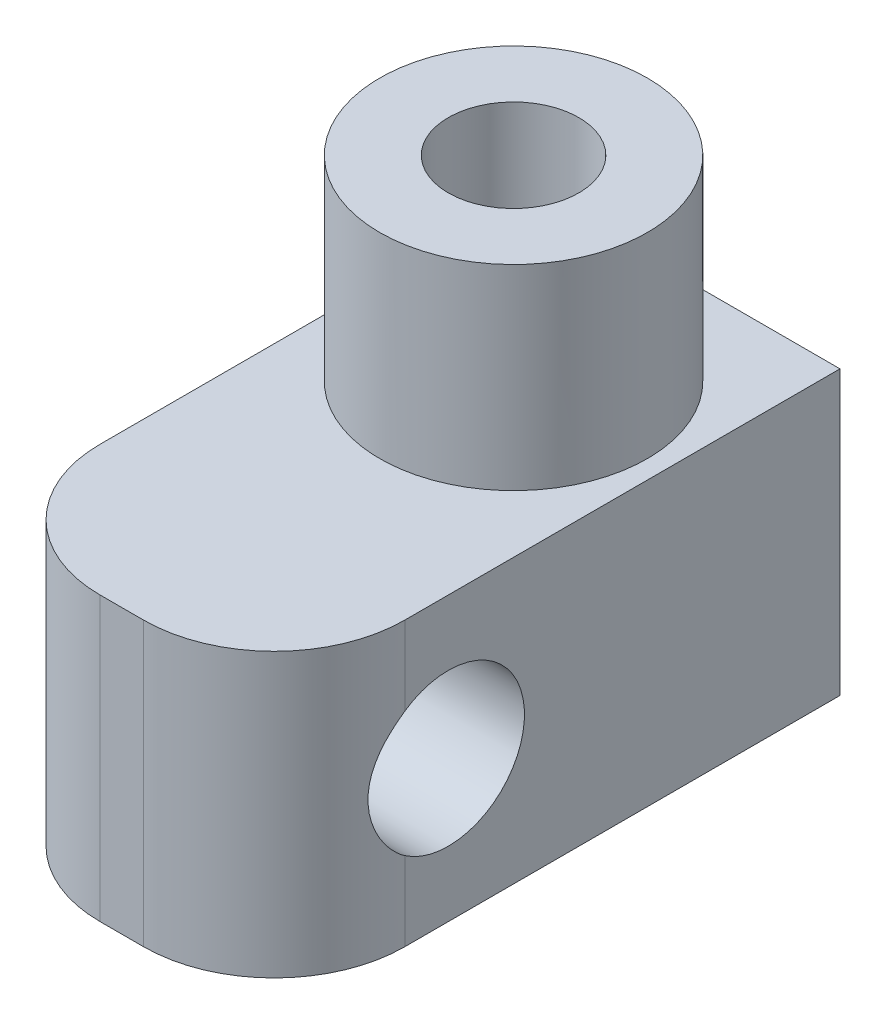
ISO-10303-21;
HEADER;
FILE_DESCRIPTION(('STEP AP214'),'2;1');
FILE_NAME('part.step','',(''),(''),'','','');
FILE_SCHEMA(('AUTOMOTIVE_DESIGN { 1 0 10303 214 1 1 1 1 }'));
ENDSEC;
DATA;
#1=APPLICATION_CONTEXT('core data for automotive mechanical design processes');
#2=APPLICATION_PROTOCOL_DEFINITION('international standard','automotive_design',2000,#1);
#3=PRODUCT_CONTEXT('',#1,'mechanical');
#4=PRODUCT('Part','Part','',(#3));
#5=PRODUCT_RELATED_PRODUCT_CATEGORY('part','',(#4));
#6=PRODUCT_DEFINITION_FORMATION('','',#4);
#7=PRODUCT_DEFINITION_CONTEXT('part definition',#1,'design');
#8=PRODUCT_DEFINITION('design','',#6,#7);
#9=PRODUCT_DEFINITION_SHAPE('','',#8);
#10=(LENGTH_UNIT() NAMED_UNIT(*) SI_UNIT(.MILLI.,.METRE.));
#11=(NAMED_UNIT(*) PLANE_ANGLE_UNIT() SI_UNIT($,.RADIAN.));
#12=(NAMED_UNIT(*) SI_UNIT($,.STERADIAN.) SOLID_ANGLE_UNIT());
#13=UNCERTAINTY_MEASURE_WITH_UNIT(LENGTH_MEASURE(1.E-05),#10,'distance_accuracy_value','');
#14=(GEOMETRIC_REPRESENTATION_CONTEXT(3) GLOBAL_UNCERTAINTY_ASSIGNED_CONTEXT((#13)) GLOBAL_UNIT_ASSIGNED_CONTEXT((#10,
#11,#12)) REPRESENTATION_CONTEXT('',''));
#15=CARTESIAN_POINT('',(0.,0.,0.));
#16=DIRECTION('',(0.,0.,1.));
#17=DIRECTION('',(1.,0.,0.));
#18=AXIS2_PLACEMENT_3D('',#15,#16,#17);
#19=CARTESIAN_POINT('',(0.,0.,0.));
#20=DIRECTION('',(0.,1.,0.));
#21=DIRECTION('',(0.,0.,1.));
#22=AXIS2_PLACEMENT_3D('',#19,#20,#21);
#23=CYLINDRICAL_SURFACE('',#22,1.5);
#24=CARTESIAN_POINT('',(0.,11.,0.));
#25=DIRECTION('',(0.,1.,0.));
#26=DIRECTION('',(0.,0.,1.));
#27=AXIS2_PLACEMENT_3D('',#24,#25,#26);
#28=CIRCLE('',#27,1.5);
#29=CARTESIAN_POINT('',(0.,11.,1.5));
#30=VERTEX_POINT('',#29);
#31=EDGE_CURVE('E165',#30,#30,#28,.T.);
#32=ORIENTED_EDGE('',*,*,#31,.T.);
#33=EDGE_LOOP('',(#32));
#34=FACE_BOUND('',#33,.T.);
#35=CARTESIAN_POINT('',(0.,2.,0.));
#36=DIRECTION('',(0.,-1.,0.));
#37=DIRECTION('',(0.,0.,-1.));
#38=AXIS2_PLACEMENT_3D('',#35,#36,#37);
#39=CIRCLE('',#38,1.5);
#40=CARTESIAN_POINT('',(0.,2.,-1.5));
#41=VERTEX_POINT('',#40);
#42=EDGE_CURVE('E37',#41,#41,#39,.F.);
#43=ORIENTED_EDGE('',*,*,#42,.F.);
#44=EDGE_LOOP('',(#43));
#45=FACE_BOUND('',#44,.T.);
#46=ADVANCED_FACE('F33',(#34,#45),#23,.F.);
#47=CARTESIAN_POINT('',(0.,11.,0.));
#48=DIRECTION('',(0.,-1.,0.));
#49=DIRECTION('',(0.,0.,-1.));
#50=AXIS2_PLACEMENT_3D('',#47,#48,#49);
#51=CYLINDRICAL_SURFACE('',#50,3.075);
#52=CARTESIAN_POINT('',(0.,11.,0.));
#53=DIRECTION('',(0.,1.,0.));
#54=DIRECTION('',(0.,0.,1.));
#55=AXIS2_PLACEMENT_3D('',#52,#53,#54);
#56=CIRCLE('',#55,3.075);
#57=CARTESIAN_POINT('',(0.,11.,3.075));
#58=VERTEX_POINT('',#57);
#59=EDGE_CURVE('E42',#58,#58,#56,.T.);
#60=ORIENTED_EDGE('',*,*,#59,.F.);
#61=EDGE_LOOP('',(#60));
#62=FACE_BOUND('',#61,.T.);
#63=CARTESIAN_POINT('',(0.,6.5,0.));
#64=DIRECTION('',(0.,-1.,0.));
#65=DIRECTION('',(0.,0.,-1.));
#66=AXIS2_PLACEMENT_3D('',#63,#64,#65);
#67=CIRCLE('',#66,3.075);
#68=CARTESIAN_POINT('',(0.,6.5,-3.075));
#69=VERTEX_POINT('',#68);
#70=EDGE_CURVE('E11',#69,#69,#67,.T.);
#71=ORIENTED_EDGE('',*,*,#70,.F.);
#72=EDGE_LOOP('',(#71));
#73=FACE_BOUND('',#72,.T.);
#74=ADVANCED_FACE('F35',(#62,#73),#51,.T.);
#75=CARTESIAN_POINT('',(0.,11.,0.));
#76=DIRECTION('',(0.,1.,0.));
#77=DIRECTION('',(0.,0.,1.));
#78=AXIS2_PLACEMENT_3D('',#75,#76,#77);
#79=PLANE('',#78);
#80=ORIENTED_EDGE('',*,*,#31,.F.);
#81=EDGE_LOOP('',(#80));
#82=FACE_BOUND('',#81,.T.);
#83=ORIENTED_EDGE('',*,*,#59,.T.);
#84=EDGE_LOOP('',(#83));
#85=FACE_BOUND('',#84,.T.);
#86=ADVANCED_FACE('F238',(#82,#85),#79,.T.);
#87=CARTESIAN_POINT('',(-3.5,6.5,-4.));
#88=DIRECTION('',(0.,0.,-1.));
#89=DIRECTION('',(-1.,0.,0.));
#90=AXIS2_PLACEMENT_3D('',#87,#88,#89);
#91=PLANE('',#90);
#92=DIRECTION('',(1.,0.,0.));
#93=VECTOR('',#92,1.);
#94=CARTESIAN_POINT('',(-3.5,0.,-4.));
#95=LINE('',#94,#93);
#96=CARTESIAN_POINT('',(-3.5,0.,-4.));
#97=VERTEX_POINT('',#96);
#98=CARTESIAN_POINT('',(3.5,0.,-4.));
#99=VERTEX_POINT('',#98);
#100=EDGE_CURVE('E175',#97,#99,#95,.T.);
#101=ORIENTED_EDGE('',*,*,#100,.F.);
#102=DIRECTION('',(0.,-1.,0.));
#103=VECTOR('',#102,1.);
#104=CARTESIAN_POINT('',(-3.5,6.5,-4.));
#105=LINE('',#104,#103);
#106=CARTESIAN_POINT('',(-3.5,6.5,-4.));
#107=VERTEX_POINT('',#106);
#108=EDGE_CURVE('E126',#107,#97,#105,.T.);
#109=ORIENTED_EDGE('',*,*,#108,.F.);
#110=DIRECTION('',(1.,0.,0.));
#111=VECTOR('',#110,1.);
#112=CARTESIAN_POINT('',(-3.5,6.5,-4.));
#113=LINE('',#112,#111);
#114=CARTESIAN_POINT('',(3.5,6.5,-4.));
#115=VERTEX_POINT('',#114);
#116=EDGE_CURVE('E157',#107,#115,#113,.T.);
#117=ORIENTED_EDGE('',*,*,#116,.T.);
#118=DIRECTION('',(0.,-1.,0.));
#119=VECTOR('',#118,1.);
#120=CARTESIAN_POINT('',(3.5,6.5,-4.));
#121=LINE('',#120,#119);
#122=EDGE_CURVE('E120',#115,#99,#121,.T.);
#123=ORIENTED_EDGE('',*,*,#122,.T.);
#124=EDGE_LOOP('',(#101,#109,#117,#123));
#125=FACE_BOUND('',#124,.T.);
#126=ADVANCED_FACE('F223',(#125),#91,.T.);
#127=CARTESIAN_POINT('',(-3.5,6.5,5.99999999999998));
#128=DIRECTION('',(-1.,0.,0.));
#129=DIRECTION('',(0.,0.,1.));
#130=AXIS2_PLACEMENT_3D('',#127,#128,#129);
#131=PLANE('',#130);
#132=CARTESIAN_POINT('',(-3.5,3.25,5.));
#133=DIRECTION('',(-1.,0.,0.));
#134=DIRECTION('',(0.,0.,1.));
#135=AXIS2_PLACEMENT_3D('',#132,#133,#134);
#136=CIRCLE('',#135,1.75);
#137=CARTESIAN_POINT('',(-3.5,4.68614066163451,5.99999999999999));
#138=VERTEX_POINT('',#137);
#139=CARTESIAN_POINT('',(-3.5,1.81385933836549,5.99999999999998));
#140=VERTEX_POINT('',#139);
#141=EDGE_CURVE('E48',#138,#140,#136,.T.);
#142=ORIENTED_EDGE('',*,*,#141,.F.);
#143=DIRECTION('',(0.,-1.,0.));
#144=VECTOR('',#143,1.);
#145=CARTESIAN_POINT('',(-3.5,6.5,5.99999999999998));
#146=LINE('',#145,#144);
#147=CARTESIAN_POINT('',(-3.5,6.5,5.99999999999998));
#148=VERTEX_POINT('',#147);
#149=EDGE_CURVE('E129',#148,#138,#146,.T.);
#150=ORIENTED_EDGE('',*,*,#149,.F.);
#151=DIRECTION('',(0.,0.,-1.));
#152=VECTOR('',#151,1.);
#153=CARTESIAN_POINT('',(-3.5,6.5,5.99999999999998));
#154=LINE('',#153,#152);
#155=EDGE_CURVE('E124',#148,#107,#154,.T.);
#156=ORIENTED_EDGE('',*,*,#155,.T.);
#157=ORIENTED_EDGE('',*,*,#108,.T.);
#158=DIRECTION('',(0.,0.,-1.));
#159=VECTOR('',#158,1.);
#160=CARTESIAN_POINT('',(-3.5,0.,5.99999999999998));
#161=LINE('',#160,#159);
#162=CARTESIAN_POINT('',(-3.5,0.,5.99999999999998));
#163=VERTEX_POINT('',#162);
#164=EDGE_CURVE('E139',#163,#97,#161,.T.);
#165=ORIENTED_EDGE('',*,*,#164,.F.);
#166=EDGE_CURVE('E136',#140,#163,#146,.T.);
#167=ORIENTED_EDGE('',*,*,#166,.F.);
#168=EDGE_LOOP('',(#142,#150,#156,#157,#165,#167));
#169=FACE_BOUND('',#168,.T.);
#170=ADVANCED_FACE('F156',(#169),#131,.T.);
#171=CARTESIAN_POINT('',(-0.499999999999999,6.5,5.99999999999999));
#172=DIRECTION('',(0.,-1.,0.));
#173=DIRECTION('',(0.,0.,-1.));
#174=AXIS2_PLACEMENT_3D('',#171,#172,#173);
#175=CYLINDRICAL_SURFACE('',#174,3.);
#176=CARTESIAN_POINT('',(-3.5,1.81385933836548,5.99999999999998));
#177=CARTESIAN_POINT('',(-3.50000169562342,1.84168165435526,6.03995888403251));
#178=CARTESIAN_POINT('',(-3.49920147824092,1.87115612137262,6.07872827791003));
#179=CARTESIAN_POINT('',(-3.49629741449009,1.93318979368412,6.15363572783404));
#180=CARTESIAN_POINT('',(-3.49419414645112,1.9657476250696,6.18977494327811));
#181=CARTESIAN_POINT('',(-3.48639021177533,2.06760227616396,6.29376343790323));
#182=CARTESIAN_POINT('',(-3.47919269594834,2.1412082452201,6.3573667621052));
#183=CARTESIAN_POINT('',(-3.46329629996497,2.29768029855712,6.47138199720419));
#184=CARTESIAN_POINT('',(-3.45459884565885,2.38053756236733,6.52180632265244));
#185=CARTESIAN_POINT('',(-3.43800373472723,2.55352099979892,6.60834182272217));
#186=CARTESIAN_POINT('',(-3.43010615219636,2.64364784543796,6.64445167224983));
#187=CARTESIAN_POINT('',(-3.41689427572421,2.83062169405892,6.70187174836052));
#188=CARTESIAN_POINT('',(-3.41163289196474,2.92756494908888,6.72288226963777));
#189=CARTESIAN_POINT('',(-3.40522265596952,3.12373481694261,6.7482368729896));
#190=CARTESIAN_POINT('',(-3.40407291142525,3.22296092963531,6.75258457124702));
#191=CARTESIAN_POINT('',(-3.40613155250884,3.417734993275,6.74458757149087));
#192=CARTESIAN_POINT('',(-3.40921202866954,3.51330492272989,6.73273283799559));
#193=CARTESIAN_POINT('',(-3.41879004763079,3.70106465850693,6.69358823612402));
#194=CARTESIAN_POINT('',(-3.4252884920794,3.79325356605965,6.66629429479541));
#195=CARTESIAN_POINT('',(-3.44023244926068,3.97227100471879,6.59690166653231));
#196=CARTESIAN_POINT('',(-3.44868835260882,4.05906767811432,6.55472332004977));
#197=CARTESIAN_POINT('',(-3.46544777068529,4.22454651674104,6.45670830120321));
#198=CARTESIAN_POINT('',(-3.47375136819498,4.30323320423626,6.40087929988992));
#199=CARTESIAN_POINT('',(-3.48639910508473,4.43544099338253,6.28960866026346));
#200=CARTESIAN_POINT('',(-3.49120548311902,4.49082037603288,6.23641419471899));
#201=CARTESIAN_POINT('',(-3.49801131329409,4.59422984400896,6.123144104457));
#202=CARTESIAN_POINT('',(-3.50001035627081,4.64225885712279,6.06306747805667));
#203=CARTESIAN_POINT('',(-3.5,4.68614066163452,5.99999999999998));
#204=B_SPLINE_CURVE_WITH_KNOTS('',3,(#176,#177,#178,#179,#180,#181,#182,#183,#184,#185,#186,
#187,#188,#189,#190,#191,#192,#193,#194,#195,#196,#197,#198,#199,#200,#201,#202,#203),
.UNSPECIFIED.,.F.,.F.,(4,2,2,2,2,2,2,2,2,2,2,2,2,4),(0.,0.145964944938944,0.291865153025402,
0.58300404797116,0.873867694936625,1.16475826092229,1.46127418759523,1.75772576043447,
2.04540815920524,2.33316648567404,2.62248881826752,2.91164893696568,3.14178404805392,
3.3719526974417),.UNSPECIFIED.);
#205=EDGE_CURVE('E109',#140,#138,#204,.T.);
#206=ORIENTED_EDGE('',*,*,#205,.F.);
#207=ORIENTED_EDGE('',*,*,#166,.T.);
#208=CARTESIAN_POINT('',(-0.499999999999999,0.,5.99999999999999));
#209=DIRECTION('',(0.,-1.,0.));
#210=DIRECTION('',(0.,0.,1.));
#211=AXIS2_PLACEMENT_3D('',#208,#209,#210);
#212=CIRCLE('',#211,3.);
#213=CARTESIAN_POINT('',(-0.499999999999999,0.,9.));
#214=VERTEX_POINT('',#213);
#215=EDGE_CURVE('E148',#214,#163,#212,.T.);
#216=ORIENTED_EDGE('',*,*,#215,.F.);
#217=DIRECTION('',(0.,-1.,0.));
#218=VECTOR('',#217,1.);
#219=CARTESIAN_POINT('',(-0.499999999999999,6.5,9.));
#220=LINE('',#219,#218);
#221=CARTESIAN_POINT('',(-0.499999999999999,6.5,9.));
#222=VERTEX_POINT('',#221);
#223=EDGE_CURVE('E118',#222,#214,#220,.T.);
#224=ORIENTED_EDGE('',*,*,#223,.F.);
#225=CARTESIAN_POINT('',(-0.499999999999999,6.5,5.99999999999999));
#226=DIRECTION('',(0.,-1.,0.));
#227=DIRECTION('',(0.,0.,1.));
#228=AXIS2_PLACEMENT_3D('',#225,#226,#227);
#229=CIRCLE('',#228,3.);
#230=EDGE_CURVE('E171',#222,#148,#229,.T.);
#231=ORIENTED_EDGE('',*,*,#230,.T.);
#232=ORIENTED_EDGE('',*,*,#149,.T.);
#233=EDGE_LOOP('',(#206,#207,#216,#224,#231,#232));
#234=FACE_BOUND('',#233,.T.);
#235=ADVANCED_FACE('F147',(#234),#175,.T.);
#236=CARTESIAN_POINT('',(0.,6.5,9.));
#237=DIRECTION('',(0.,0.,1.));
#238=DIRECTION('',(1.,0.,0.));
#239=AXIS2_PLACEMENT_3D('',#236,#237,#238);
#240=PLANE('',#239);
#241=DIRECTION('',(-1.,0.,0.));
#242=VECTOR('',#241,1.);
#243=CARTESIAN_POINT('',(0.,0.,9.));
#244=LINE('',#243,#242);
#245=CARTESIAN_POINT('',(0.499999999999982,0.,9.));
#246=VERTEX_POINT('',#245);
#247=EDGE_CURVE('E155',#246,#214,#244,.T.);
#248=ORIENTED_EDGE('',*,*,#247,.F.);
#249=DIRECTION('',(0.,-1.,0.));
#250=VECTOR('',#249,1.);
#251=CARTESIAN_POINT('',(0.499999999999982,6.5,9.));
#252=LINE('',#251,#250);
#253=CARTESIAN_POINT('',(0.499999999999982,6.5,9.));
#254=VERTEX_POINT('',#253);
#255=EDGE_CURVE('E115',#254,#246,#252,.T.);
#256=ORIENTED_EDGE('',*,*,#255,.F.);
#257=DIRECTION('',(-1.,0.,0.));
#258=VECTOR('',#257,1.);
#259=CARTESIAN_POINT('',(0.499999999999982,6.5,9.));
#260=LINE('',#259,#258);
#261=EDGE_CURVE('E169',#254,#222,#260,.T.);
#262=ORIENTED_EDGE('',*,*,#261,.T.);
#263=ORIENTED_EDGE('',*,*,#223,.T.);
#264=EDGE_LOOP('',(#248,#256,#262,#263));
#265=FACE_BOUND('',#264,.T.);
#266=ADVANCED_FACE('F184',(#265),#240,.T.);
#267=CARTESIAN_POINT('',(0.499999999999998,6.5,5.99999999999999));
#268=DIRECTION('',(0.,-1.,0.));
#269=DIRECTION('',(0.,0.,-1.));
#270=AXIS2_PLACEMENT_3D('',#267,#268,#269);
#271=CYLINDRICAL_SURFACE('',#270,3.);
#272=CARTESIAN_POINT('',(3.5,4.68614066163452,5.99999999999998));
#273=CARTESIAN_POINT('',(3.50000169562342,4.65831834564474,6.03995888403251));
#274=CARTESIAN_POINT('',(3.49920147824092,4.62884387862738,6.07872827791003));
#275=CARTESIAN_POINT('',(3.49629741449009,4.56681020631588,6.15363572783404));
#276=CARTESIAN_POINT('',(3.49419414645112,4.5342523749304,6.18977494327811));
#277=CARTESIAN_POINT('',(3.48639021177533,4.43239772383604,6.29376343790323));
#278=CARTESIAN_POINT('',(3.47919269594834,4.3587917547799,6.3573667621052));
#279=CARTESIAN_POINT('',(3.46329629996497,4.20231970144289,6.47138199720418));
#280=CARTESIAN_POINT('',(3.45459884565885,4.11946243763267,6.52180632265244));
#281=CARTESIAN_POINT('',(3.43800373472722,3.94647900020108,6.60834182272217));
#282=CARTESIAN_POINT('',(3.43010615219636,3.85635215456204,6.64445167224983));
#283=CARTESIAN_POINT('',(3.41689427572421,3.66937830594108,6.70187174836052));
#284=CARTESIAN_POINT('',(3.41163289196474,3.57243505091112,6.72288226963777));
#285=CARTESIAN_POINT('',(3.40522265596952,3.37626518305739,6.7482368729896));
#286=CARTESIAN_POINT('',(3.40407291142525,3.2770390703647,6.75258457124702));
#287=CARTESIAN_POINT('',(3.40613155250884,3.08226500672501,6.74458757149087));
#288=CARTESIAN_POINT('',(3.40921202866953,2.98669507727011,6.73273283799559));
#289=CARTESIAN_POINT('',(3.41879004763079,2.79893534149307,6.69358823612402));
#290=CARTESIAN_POINT('',(3.4252884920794,2.70674643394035,6.66629429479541));
#291=CARTESIAN_POINT('',(3.44023244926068,2.52772899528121,6.59690166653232));
#292=CARTESIAN_POINT('',(3.44868835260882,2.44093232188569,6.55472332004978));
#293=CARTESIAN_POINT('',(3.46544777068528,2.27545348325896,6.45670830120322));
#294=CARTESIAN_POINT('',(3.47375136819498,2.19676679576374,6.40087929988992));
#295=CARTESIAN_POINT('',(3.48639910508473,2.06455900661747,6.28960866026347));
#296=CARTESIAN_POINT('',(3.49120548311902,2.00917962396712,6.23641419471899));
#297=CARTESIAN_POINT('',(3.49801131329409,1.90577015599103,6.123144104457));
#298=CARTESIAN_POINT('',(3.50001035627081,1.85774114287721,6.06306747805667));
#299=CARTESIAN_POINT('',(3.5,1.81385933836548,5.99999999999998));
#300=B_SPLINE_CURVE_WITH_KNOTS('',3,(#272,#273,#274,#275,#276,#277,#278,#279,#280,#281,#282,
#283,#284,#285,#286,#287,#288,#289,#290,#291,#292,#293,#294,#295,#296,#297,#298,#299),
.UNSPECIFIED.,.F.,.F.,(4,2,2,2,2,2,2,2,2,2,2,2,2,4),(0.,0.145964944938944,0.291865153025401,
0.583004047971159,0.873867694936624,1.16475826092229,1.46127418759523,1.75772576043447,
2.04540815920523,2.33316648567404,2.62248881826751,2.91164893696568,3.14178404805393,
3.37195269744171),.UNSPECIFIED.);
#301=CARTESIAN_POINT('',(3.5,4.68614066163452,5.99999999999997));
#302=VERTEX_POINT('',#301);
#303=CARTESIAN_POINT('',(3.5,1.81385933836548,5.99999999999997));
#304=VERTEX_POINT('',#303);
#305=EDGE_CURVE('E55',#302,#304,#300,.T.);
#306=ORIENTED_EDGE('',*,*,#305,.F.);
#307=DIRECTION('',(0.,-1.,0.));
#308=VECTOR('',#307,1.);
#309=CARTESIAN_POINT('',(3.5,6.5,5.99999999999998));
#310=LINE('',#309,#308);
#311=CARTESIAN_POINT('',(3.5,6.5,5.99999999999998));
#312=VERTEX_POINT('',#311);
#313=EDGE_CURVE('E105',#312,#302,#310,.T.);
#314=ORIENTED_EDGE('',*,*,#313,.F.);
#315=CARTESIAN_POINT('',(0.499999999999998,6.5,5.99999999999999));
#316=DIRECTION('',(0.,-1.,0.));
#317=DIRECTION('',(0.,0.,-1.));
#318=AXIS2_PLACEMENT_3D('',#315,#316,#317);
#319=CIRCLE('',#318,3.);
#320=EDGE_CURVE('E162',#312,#254,#319,.T.);
#321=ORIENTED_EDGE('',*,*,#320,.T.);
#322=ORIENTED_EDGE('',*,*,#255,.T.);
#323=CARTESIAN_POINT('',(0.499999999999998,0.,5.99999999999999));
#324=DIRECTION('',(0.,-1.,0.));
#325=DIRECTION('',(0.,0.,-1.));
#326=AXIS2_PLACEMENT_3D('',#323,#324,#325);
#327=CIRCLE('',#326,3.);
#328=CARTESIAN_POINT('',(3.5,0.,5.99999999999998));
#329=VERTEX_POINT('',#328);
#330=EDGE_CURVE('E180',#329,#246,#327,.T.);
#331=ORIENTED_EDGE('',*,*,#330,.F.);
#332=EDGE_CURVE('E108',#304,#329,#310,.T.);
#333=ORIENTED_EDGE('',*,*,#332,.F.);
#334=EDGE_LOOP('',(#306,#314,#321,#322,#331,#333));
#335=FACE_BOUND('',#334,.T.);
#336=ADVANCED_FACE('F103',(#335),#271,.T.);
#337=CARTESIAN_POINT('',(3.5,6.5,-4.));
#338=DIRECTION('',(1.,0.,0.));
#339=DIRECTION('',(0.,0.,-1.));
#340=AXIS2_PLACEMENT_3D('',#337,#338,#339);
#341=PLANE('',#340);
#342=CARTESIAN_POINT('',(3.5,3.25,5.));
#343=DIRECTION('',(-1.,0.,0.));
#344=DIRECTION('',(0.,0.,1.));
#345=AXIS2_PLACEMENT_3D('',#342,#343,#344);
#346=CIRCLE('',#345,1.75);
#347=EDGE_CURVE('E96',#302,#304,#346,.T.);
#348=ORIENTED_EDGE('',*,*,#347,.T.);
#349=ORIENTED_EDGE('',*,*,#332,.T.);
#350=DIRECTION('',(0.,0.,1.));
#351=VECTOR('',#350,1.);
#352=CARTESIAN_POINT('',(3.5,0.,-4.));
#353=LINE('',#352,#351);
#354=EDGE_CURVE('E177',#99,#329,#353,.T.);
#355=ORIENTED_EDGE('',*,*,#354,.F.);
#356=ORIENTED_EDGE('',*,*,#122,.F.);
#357=DIRECTION('',(0.,0.,1.));
#358=VECTOR('',#357,1.);
#359=CARTESIAN_POINT('',(3.5,6.5,-4.));
#360=LINE('',#359,#358);
#361=EDGE_CURVE('E114',#115,#312,#360,.T.);
#362=ORIENTED_EDGE('',*,*,#361,.T.);
#363=ORIENTED_EDGE('',*,*,#313,.T.);
#364=EDGE_LOOP('',(#348,#349,#355,#356,#362,#363));
#365=FACE_BOUND('',#364,.T.);
#366=ADVANCED_FACE('F112',(#365),#341,.T.);
#367=CARTESIAN_POINT('',(0.499999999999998,6.5,5.99999999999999));
#368=DIRECTION('',(0.,-1.,0.));
#369=DIRECTION('',(0.,0.,-1.));
#370=AXIS2_PLACEMENT_3D('',#367,#368,#369);
#371=PLANE('',#370);
#372=ORIENTED_EDGE('',*,*,#70,.T.);
#373=EDGE_LOOP('',(#372));
#374=FACE_BOUND('',#373,.T.);
#375=ORIENTED_EDGE('',*,*,#116,.F.);
#376=ORIENTED_EDGE('',*,*,#155,.F.);
#377=ORIENTED_EDGE('',*,*,#230,.F.);
#378=ORIENTED_EDGE('',*,*,#261,.F.);
#379=ORIENTED_EDGE('',*,*,#320,.F.);
#380=ORIENTED_EDGE('',*,*,#361,.F.);
#381=EDGE_LOOP('',(#375,#376,#377,#378,#379,#380));
#382=FACE_BOUND('',#381,.T.);
#383=ADVANCED_FACE('F187',(#374,#382),#371,.F.);
#384=CARTESIAN_POINT('',(0.,0.,0.));
#385=DIRECTION('',(0.,1.,0.));
#386=DIRECTION('',(0.,0.,1.));
#387=AXIS2_PLACEMENT_3D('',#384,#385,#386);
#388=PLANE('',#387);
#389=CARTESIAN_POINT('',(0.,0.,0.));
#390=DIRECTION('',(0.,-1.,0.));
#391=DIRECTION('',(0.,0.,-1.));
#392=AXIS2_PLACEMENT_3D('',#389,#390,#391);
#393=CIRCLE('',#392,3.);
#394=CARTESIAN_POINT('',(0.,0.,-3.));
#395=VERTEX_POINT('',#394);
#396=EDGE_CURVE('E247',#395,#395,#393,.T.);
#397=ORIENTED_EDGE('',*,*,#396,.F.);
#398=EDGE_LOOP('',(#397));
#399=FACE_BOUND('',#398,.T.);
#400=ORIENTED_EDGE('',*,*,#100,.T.);
#401=ORIENTED_EDGE('',*,*,#354,.T.);
#402=ORIENTED_EDGE('',*,*,#330,.T.);
#403=ORIENTED_EDGE('',*,*,#247,.T.);
#404=ORIENTED_EDGE('',*,*,#215,.T.);
#405=ORIENTED_EDGE('',*,*,#164,.T.);
#406=EDGE_LOOP('',(#400,#401,#402,#403,#404,#405));
#407=FACE_BOUND('',#406,.T.);
#408=ADVANCED_FACE('F153',(#399,#407),#388,.F.);
#409=CARTESIAN_POINT('',(0.,2.,0.));
#410=DIRECTION('',(0.,-1.,0.));
#411=DIRECTION('',(0.,0.,-1.));
#412=AXIS2_PLACEMENT_3D('',#409,#410,#411);
#413=PLANE('',#412);
#414=CARTESIAN_POINT('',(0.,2.,0.));
#415=DIRECTION('',(0.,-1.,0.));
#416=DIRECTION('',(0.,0.,-1.));
#417=AXIS2_PLACEMENT_3D('',#414,#415,#416);
#418=CIRCLE('',#417,3.);
#419=CARTESIAN_POINT('',(0.,2.,-3.));
#420=VERTEX_POINT('',#419);
#421=EDGE_CURVE('E249',#420,#420,#418,.T.);
#422=ORIENTED_EDGE('',*,*,#421,.T.);
#423=EDGE_LOOP('',(#422));
#424=FACE_BOUND('',#423,.T.);
#425=ORIENTED_EDGE('',*,*,#42,.T.);
#426=EDGE_LOOP('',(#425));
#427=FACE_BOUND('',#426,.T.);
#428=ADVANCED_FACE('F208',(#424,#427),#413,.T.);
#429=CARTESIAN_POINT('',(0.,2.,0.));
#430=DIRECTION('',(0.,-1.,0.));
#431=DIRECTION('',(0.,0.,-1.));
#432=AXIS2_PLACEMENT_3D('',#429,#430,#431);
#433=CYLINDRICAL_SURFACE('',#432,3.);
#434=ORIENTED_EDGE('',*,*,#421,.F.);
#435=EDGE_LOOP('',(#434));
#436=FACE_BOUND('',#435,.T.);
#437=ORIENTED_EDGE('',*,*,#396,.T.);
#438=EDGE_LOOP('',(#437));
#439=FACE_BOUND('',#438,.T.);
#440=ADVANCED_FACE('F207',(#436,#439),#433,.F.);
#441=CARTESIAN_POINT('',(3.5,3.25,5.));
#442=DIRECTION('',(-1.,0.,0.));
#443=DIRECTION('',(0.,0.,1.));
#444=AXIS2_PLACEMENT_3D('',#441,#442,#443);
#445=CYLINDRICAL_SURFACE('',#444,1.75);
#446=ORIENTED_EDGE('',*,*,#205,.T.);
#447=ORIENTED_EDGE('',*,*,#141,.T.);
#448=EDGE_LOOP('',(#446,#447));
#449=FACE_BOUND('',#448,.T.);
#450=ORIENTED_EDGE('',*,*,#305,.T.);
#451=ORIENTED_EDGE('',*,*,#347,.F.);
#452=EDGE_LOOP('',(#450,#451));
#453=FACE_BOUND('',#452,.T.);
#454=ADVANCED_FACE('F97',(#449,#453),#445,.F.);
#455=CLOSED_SHELL('',(#46,#74,#86,#126,#170,#235,#266,#336,#366,#383,#408,#428,#440,#454));
#456=MANIFOLD_SOLID_BREP('B2',#455);
#457=ADVANCED_BREP_SHAPE_REPRESENTATION('',(#18,#456),#14);
#458=SHAPE_DEFINITION_REPRESENTATION(#9,#457);
ENDSEC;
END-ISO-10303-21;
